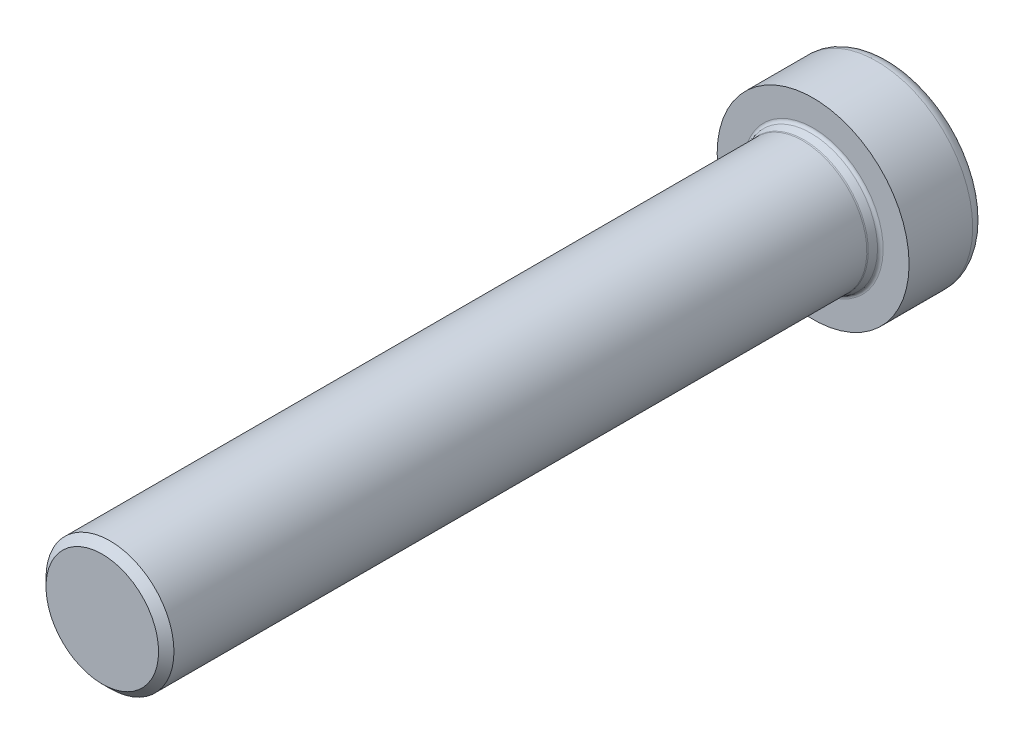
ISO-10303-21;
HEADER;
FILE_DESCRIPTION(('STEP AP214'),'2;1');
FILE_NAME('part.step','',(''),(''),'','','');
FILE_SCHEMA(('AUTOMOTIVE_DESIGN { 1 0 10303 214 1 1 1 1 }'));
ENDSEC;
DATA;
#1=APPLICATION_CONTEXT('core data for automotive mechanical design processes');
#2=APPLICATION_PROTOCOL_DEFINITION('international standard','automotive_design',2000,#1);
#3=PRODUCT_CONTEXT('',#1,'mechanical');
#4=PRODUCT('Part','Part','',(#3));
#5=PRODUCT_RELATED_PRODUCT_CATEGORY('part','',(#4));
#6=PRODUCT_DEFINITION_FORMATION('','',#4);
#7=PRODUCT_DEFINITION_CONTEXT('part definition',#1,'design');
#8=PRODUCT_DEFINITION('design','',#6,#7);
#9=PRODUCT_DEFINITION_SHAPE('','',#8);
#10=(LENGTH_UNIT() NAMED_UNIT(*) SI_UNIT(.MILLI.,.METRE.));
#11=(NAMED_UNIT(*) PLANE_ANGLE_UNIT() SI_UNIT($,.RADIAN.));
#12=(NAMED_UNIT(*) SI_UNIT($,.STERADIAN.) SOLID_ANGLE_UNIT());
#13=UNCERTAINTY_MEASURE_WITH_UNIT(LENGTH_MEASURE(1.E-05),#10,'distance_accuracy_value','');
#14=(GEOMETRIC_REPRESENTATION_CONTEXT(3) GLOBAL_UNCERTAINTY_ASSIGNED_CONTEXT((#13)) GLOBAL_UNIT_ASSIGNED_CONTEXT((#10,
#11,#12)) REPRESENTATION_CONTEXT('',''));
#15=CARTESIAN_POINT('',(0.,0.,0.));
#16=DIRECTION('',(0.,0.,1.));
#17=DIRECTION('',(1.,0.,0.));
#18=AXIS2_PLACEMENT_3D('',#15,#16,#17);
#19=CARTESIAN_POINT('',(0.,0.,200.));
#20=DIRECTION('',(0.,0.,-1.));
#21=DIRECTION('',(-1.,0.,0.));
#22=AXIS2_PLACEMENT_3D('',#19,#20,#21);
#23=CYLINDRICAL_SURFACE('',#22,18.);
#24=CARTESIAN_POINT('',(0.,0.,2.89));
#25=DIRECTION('',(0.,0.,-1.));
#26=DIRECTION('',(-1.,0.,0.));
#27=AXIS2_PLACEMENT_3D('',#24,#25,#26);
#28=CIRCLE('',#27,18.);
#29=CARTESIAN_POINT('',(-18.,0.,2.89));
#30=VERTEX_POINT('',#29);
#31=EDGE_CURVE('E13',#30,#30,#28,.T.);
#32=ORIENTED_EDGE('',*,*,#31,.F.);
#33=EDGE_LOOP('',(#32));
#34=FACE_BOUND('',#33,.T.);
#35=CARTESIAN_POINT('',(0.,0.,197.835));
#36=DIRECTION('',(0.,0.,-1.));
#37=DIRECTION('',(-1.,0.,0.));
#38=AXIS2_PLACEMENT_3D('',#35,#36,#37);
#39=CIRCLE('',#38,18.);
#40=CARTESIAN_POINT('',(-18.,0.,197.835));
#41=VERTEX_POINT('',#40);
#42=EDGE_CURVE('E61',#41,#41,#39,.F.);
#43=ORIENTED_EDGE('',*,*,#42,.F.);
#44=EDGE_LOOP('',(#43));
#45=FACE_BOUND('',#44,.T.);
#46=ADVANCED_FACE('F57',(#34,#45),#23,.T.);
#47=CARTESIAN_POINT('',(0.,0.,-21.5));
#48=DIRECTION('',(0.,0.,1.));
#49=DIRECTION('',(1.,0.,0.));
#50=AXIS2_PLACEMENT_3D('',#47,#48,#49);
#51=CYLINDRICAL_SURFACE('',#50,27.);
#52=CARTESIAN_POINT('',(0.,0.,-17.9));
#53=DIRECTION('',(0.,0.,1.));
#54=DIRECTION('',(1.,0.,0.));
#55=AXIS2_PLACEMENT_3D('',#52,#53,#54);
#56=CIRCLE('',#55,27.);
#57=CARTESIAN_POINT('',(27.,0.,-17.9));
#58=VERTEX_POINT('',#57);
#59=EDGE_CURVE('E274',#58,#58,#56,.T.);
#60=ORIENTED_EDGE('',*,*,#59,.T.);
#61=EDGE_LOOP('',(#60));
#62=FACE_BOUND('',#61,.T.);
#63=CARTESIAN_POINT('',(0.,0.,0.));
#64=DIRECTION('',(0.,0.,1.));
#65=DIRECTION('',(1.,0.,0.));
#66=AXIS2_PLACEMENT_3D('',#63,#64,#65);
#67=CIRCLE('',#66,27.);
#68=CARTESIAN_POINT('',(27.,0.,0.));
#69=VERTEX_POINT('',#68);
#70=EDGE_CURVE('E271',#69,#69,#67,.T.);
#71=ORIENTED_EDGE('',*,*,#70,.F.);
#72=EDGE_LOOP('',(#71));
#73=FACE_BOUND('',#72,.T.);
#74=ADVANCED_FACE('F288',(#62,#73),#51,.T.);
#75=CARTESIAN_POINT('',(0.,0.,-21.5));
#76=DIRECTION('',(0.,0.,1.));
#77=DIRECTION('',(1.,0.,0.));
#78=AXIS2_PLACEMENT_3D('',#75,#76,#77);
#79=PLANE('',#78);
#80=DIRECTION('',(1.,0.,0.));
#81=VECTOR('',#80,1.);
#82=CARTESIAN_POINT('',(-7.62102355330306,13.5,-21.5));
#83=LINE('',#82,#81);
#84=CARTESIAN_POINT('',(-7.62102355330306,13.5,-21.5));
#85=VERTEX_POINT('',#84);
#86=CARTESIAN_POINT('',(7.62102355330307,13.5,-21.5));
#87=VERTEX_POINT('',#86);
#88=EDGE_CURVE('E73',#85,#87,#83,.T.);
#89=ORIENTED_EDGE('',*,*,#88,.F.);
#90=CARTESIAN_POINT('',(-7.62102355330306,13.2,-21.5));
#91=DIRECTION('',(0.,0.,-1.));
#92=DIRECTION('',(-1.,0.,0.));
#93=AXIS2_PLACEMENT_3D('',#90,#91,#92);
#94=CIRCLE('',#93,0.3);
#95=CARTESIAN_POINT('',(-7.88083117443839,13.35,-21.5));
#96=VERTEX_POINT('',#95);
#97=EDGE_CURVE('E155',#96,#85,#94,.T.);
#98=ORIENTED_EDGE('',*,*,#97,.F.);
#99=DIRECTION('',(0.5,0.866025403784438,0.));
#100=VECTOR('',#99,1.);
#101=CARTESIAN_POINT('',(-15.5018547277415,0.150000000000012,-21.5));
#102=LINE('',#101,#100);
#103=CARTESIAN_POINT('',(-15.5018547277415,0.150000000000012,-21.5));
#104=VERTEX_POINT('',#103);
#105=EDGE_CURVE('E173',#104,#96,#102,.T.);
#106=ORIENTED_EDGE('',*,*,#105,.F.);
#107=CARTESIAN_POINT('',(-15.2420471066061,0.,-21.5));
#108=DIRECTION('',(0.,0.,1.));
#109=DIRECTION('',(1.,0.,0.));
#110=AXIS2_PLACEMENT_3D('',#107,#108,#109);
#111=CIRCLE('',#110,0.300000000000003);
#112=CARTESIAN_POINT('',(-15.5018547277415,-0.14999999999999,-21.5));
#113=VERTEX_POINT('',#112);
#114=EDGE_CURVE('E175',#104,#113,#111,.T.);
#115=ORIENTED_EDGE('',*,*,#114,.T.);
#116=DIRECTION('',(-0.499999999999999,0.866025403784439,0.));
#117=VECTOR('',#116,1.);
#118=CARTESIAN_POINT('',(-7.8808311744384,-13.35,-21.5));
#119=LINE('',#118,#117);
#120=CARTESIAN_POINT('',(-7.8808311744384,-13.35,-21.5));
#121=VERTEX_POINT('',#120);
#122=EDGE_CURVE('E223',#121,#113,#119,.T.);
#123=ORIENTED_EDGE('',*,*,#122,.F.);
#124=CARTESIAN_POINT('',(-7.62102355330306,-13.2,-21.5));
#125=DIRECTION('',(0.,0.,-1.));
#126=DIRECTION('',(-1.,0.,0.));
#127=AXIS2_PLACEMENT_3D('',#124,#125,#126);
#128=CIRCLE('',#127,0.300000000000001);
#129=CARTESIAN_POINT('',(-7.62102355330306,-13.5,-21.5));
#130=VERTEX_POINT('',#129);
#131=EDGE_CURVE('E220',#130,#121,#128,.T.);
#132=ORIENTED_EDGE('',*,*,#131,.F.);
#133=DIRECTION('',(-1.,0.,0.));
#134=VECTOR('',#133,1.);
#135=CARTESIAN_POINT('',(7.62102355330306,-13.5,-21.5));
#136=LINE('',#135,#134);
#137=CARTESIAN_POINT('',(7.62102355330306,-13.5,-21.5));
#138=VERTEX_POINT('',#137);
#139=EDGE_CURVE('E218',#138,#130,#136,.T.);
#140=ORIENTED_EDGE('',*,*,#139,.F.);
#141=CARTESIAN_POINT('',(7.62102355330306,-13.2,-21.5));
#142=DIRECTION('',(0.,0.,-1.));
#143=DIRECTION('',(-1.,0.,0.));
#144=AXIS2_PLACEMENT_3D('',#141,#142,#143);
#145=CIRCLE('',#144,0.299999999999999);
#146=CARTESIAN_POINT('',(7.88083117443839,-13.35,-21.5));
#147=VERTEX_POINT('',#146);
#148=EDGE_CURVE('E215',#147,#138,#145,.T.);
#149=ORIENTED_EDGE('',*,*,#148,.F.);
#150=DIRECTION('',(-0.5,-0.866025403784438,0.));
#151=VECTOR('',#150,1.);
#152=CARTESIAN_POINT('',(15.5018547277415,-0.150000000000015,-21.5));
#153=LINE('',#152,#151);
#154=CARTESIAN_POINT('',(15.5018547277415,-0.150000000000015,-21.5));
#155=VERTEX_POINT('',#154);
#156=EDGE_CURVE('E213',#155,#147,#153,.T.);
#157=ORIENTED_EDGE('',*,*,#156,.F.);
#158=CARTESIAN_POINT('',(15.2420471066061,0.,-21.5));
#159=DIRECTION('',(0.,0.,-1.));
#160=DIRECTION('',(-1.,0.,0.));
#161=AXIS2_PLACEMENT_3D('',#158,#159,#160);
#162=CIRCLE('',#161,0.299999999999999);
#163=CARTESIAN_POINT('',(15.5018547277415,0.149999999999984,-21.5));
#164=VERTEX_POINT('',#163);
#165=EDGE_CURVE('E210',#164,#155,#162,.T.);
#166=ORIENTED_EDGE('',*,*,#165,.F.);
#167=DIRECTION('',(0.499999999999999,-0.866025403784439,0.));
#168=VECTOR('',#167,1.);
#169=CARTESIAN_POINT('',(7.8808311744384,13.35,-21.5));
#170=LINE('',#169,#168);
#171=CARTESIAN_POINT('',(7.8808311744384,13.35,-21.5));
#172=VERTEX_POINT('',#171);
#173=EDGE_CURVE('E208',#172,#164,#170,.T.);
#174=ORIENTED_EDGE('',*,*,#173,.F.);
#175=CARTESIAN_POINT('',(7.62102355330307,13.2,-21.5));
#176=DIRECTION('',(0.,0.,-1.));
#177=DIRECTION('',(-1.,0.,0.));
#178=AXIS2_PLACEMENT_3D('',#175,#176,#177);
#179=CIRCLE('',#178,0.300000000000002);
#180=EDGE_CURVE('E205',#87,#172,#179,.T.);
#181=ORIENTED_EDGE('',*,*,#180,.F.);
#182=EDGE_LOOP('',(#89,#98,#106,#115,#123,#132,#140,#149,#157,#166,#174,#181));
#183=FACE_BOUND('',#182,.T.);
#184=CARTESIAN_POINT('',(0.,0.,-21.5));
#185=DIRECTION('',(0.,0.,1.));
#186=DIRECTION('',(1.,0.,0.));
#187=AXIS2_PLACEMENT_3D('',#184,#185,#186);
#188=CIRCLE('',#187,23.4);
#189=CARTESIAN_POINT('',(23.4,0.,-21.5));
#190=VERTEX_POINT('',#189);
#191=EDGE_CURVE('E66',#190,#190,#188,.F.);
#192=ORIENTED_EDGE('',*,*,#191,.T.);
#193=EDGE_LOOP('',(#192));
#194=FACE_BOUND('',#193,.T.);
#195=ADVANCED_FACE('F280',(#183,#194),#79,.F.);
#196=CARTESIAN_POINT('',(0.,0.,0.));
#197=DIRECTION('',(0.,0.,1.));
#198=DIRECTION('',(1.,0.,0.));
#199=AXIS2_PLACEMENT_3D('',#196,#197,#198);
#200=PLANE('',#199);
#201=CARTESIAN_POINT('',(0.,0.,0.));
#202=DIRECTION('',(0.,0.,-1.));
#203=DIRECTION('',(0.,1.,0.));
#204=AXIS2_PLACEMENT_3D('',#201,#202,#203);
#205=CIRCLE('',#204,19.7);
#206=CARTESIAN_POINT('',(0.,19.7,0.));
#207=VERTEX_POINT('',#206);
#208=EDGE_CURVE('E265',#207,#207,#205,.T.);
#209=ORIENTED_EDGE('',*,*,#208,.T.);
#210=EDGE_LOOP('',(#209));
#211=FACE_BOUND('',#210,.T.);
#212=ORIENTED_EDGE('',*,*,#70,.T.);
#213=EDGE_LOOP('',(#212));
#214=FACE_BOUND('',#213,.T.);
#215=ADVANCED_FACE('F285',(#211,#214),#200,.T.);
#216=CARTESIAN_POINT('',(0.,0.,-17.9));
#217=DIRECTION('',(0.,0.,1.));
#218=DIRECTION('',(1.,0.,0.));
#219=AXIS2_PLACEMENT_3D('',#216,#217,#218);
#220=TOROIDAL_SURFACE('',#219,23.4,3.6);
#221=ORIENTED_EDGE('',*,*,#191,.F.);
#222=EDGE_LOOP('',(#221));
#223=FACE_BOUND('',#222,.T.);
#224=ORIENTED_EDGE('',*,*,#59,.F.);
#225=EDGE_LOOP('',(#224));
#226=FACE_BOUND('',#225,.T.);
#227=ADVANCED_FACE('F59',(#223,#226),#220,.T.);
#228=CARTESIAN_POINT('',(0.,0.,2.5426856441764));
#229=DIRECTION('',(0.,0.,-1.));
#230=DIRECTION('',(0.,1.,0.));
#231=AXIS2_PLACEMENT_3D('',#228,#229,#230);
#232=CONICAL_SURFACE('',#231,18.0622512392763,0.354705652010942);
#233=CARTESIAN_POINT('',(0.,0.,0.652685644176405));
#234=DIRECTION('',(0.,0.,-1.));
#235=DIRECTION('',(0.,1.,0.));
#236=AXIS2_PLACEMENT_3D('',#233,#234,#235);
#237=CIRCLE('',#236,18.7622512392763);
#238=CARTESIAN_POINT('',(0.,18.7622512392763,0.652685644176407));
#239=VERTEX_POINT('',#238);
#240=EDGE_CURVE('E262',#239,#239,#237,.T.);
#241=ORIENTED_EDGE('',*,*,#240,.F.);
#242=EDGE_LOOP('',(#241));
#243=FACE_BOUND('',#242,.T.);
#244=CARTESIAN_POINT('',(0.,0.,2.5426856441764));
#245=DIRECTION('',(0.,0.,-1.));
#246=DIRECTION('',(0.,1.,0.));
#247=AXIS2_PLACEMENT_3D('',#244,#245,#246);
#248=CIRCLE('',#247,18.0622512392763);
#249=CARTESIAN_POINT('',(0.,18.0622512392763,2.5426856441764));
#250=VERTEX_POINT('',#249);
#251=EDGE_CURVE('E268',#250,#250,#248,.T.);
#252=ORIENTED_EDGE('',*,*,#251,.T.);
#253=EDGE_LOOP('',(#252));
#254=FACE_BOUND('',#253,.T.);
#255=ADVANCED_FACE('F284',(#243,#254),#232,.T.);
#256=CARTESIAN_POINT('',(0.,0.,2.89));
#257=DIRECTION('',(0.,0.,-1.));
#258=DIRECTION('',(0.,1.,0.));
#259=AXIS2_PLACEMENT_3D('',#256,#257,#258);
#260=TOROIDAL_SURFACE('',#259,19.,1.);
#261=ORIENTED_EDGE('',*,*,#31,.T.);
#262=EDGE_LOOP('',(#261));
#263=FACE_BOUND('',#262,.T.);
#264=ORIENTED_EDGE('',*,*,#251,.F.);
#265=EDGE_LOOP('',(#264));
#266=FACE_BOUND('',#265,.T.);
#267=ADVANCED_FACE('F315',(#263,#266),#260,.F.);
#268=CARTESIAN_POINT('',(0.,0.,1.));
#269=DIRECTION('',(0.,0.,-1.));
#270=DIRECTION('',(0.,1.,0.));
#271=AXIS2_PLACEMENT_3D('',#268,#269,#270);
#272=TOROIDAL_SURFACE('',#271,19.7,1.);
#273=ORIENTED_EDGE('',*,*,#208,.F.);
#274=EDGE_LOOP('',(#273));
#275=FACE_BOUND('',#274,.T.);
#276=ORIENTED_EDGE('',*,*,#240,.T.);
#277=EDGE_LOOP('',(#276));
#278=FACE_BOUND('',#277,.T.);
#279=ADVANCED_FACE('F319',(#275,#278),#272,.F.);
#280=CARTESIAN_POINT('',(0.,0.,200.));
#281=DIRECTION('',(0.,0.,-1.));
#282=DIRECTION('',(1.,0.,0.));
#283=AXIS2_PLACEMENT_3D('',#280,#281,#282);
#284=CONICAL_SURFACE('',#283,15.835,0.785398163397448);
#285=CARTESIAN_POINT('',(0.,0.,200.));
#286=DIRECTION('',(0.,0.,1.));
#287=DIRECTION('',(1.,0.,0.));
#288=AXIS2_PLACEMENT_3D('',#285,#286,#287);
#289=CIRCLE('',#288,15.835);
#290=CARTESIAN_POINT('',(15.835,0.,200.));
#291=VERTEX_POINT('',#290);
#292=EDGE_CURVE('E259',#291,#291,#289,.T.);
#293=ORIENTED_EDGE('',*,*,#292,.F.);
#294=EDGE_LOOP('',(#293));
#295=FACE_BOUND('',#294,.T.);
#296=ORIENTED_EDGE('',*,*,#42,.T.);
#297=EDGE_LOOP('',(#296));
#298=FACE_BOUND('',#297,.T.);
#299=ADVANCED_FACE('F311',(#295,#298),#284,.T.);
#300=CARTESIAN_POINT('',(0.,0.,200.));
#301=DIRECTION('',(0.,0.,1.));
#302=DIRECTION('',(1.,0.,0.));
#303=AXIS2_PLACEMENT_3D('',#300,#301,#302);
#304=PLANE('',#303);
#305=ORIENTED_EDGE('',*,*,#292,.T.);
#306=EDGE_LOOP('',(#305));
#307=FACE_BOUND('',#306,.T.);
#308=ADVANCED_FACE('F308',(#307),#304,.T.);
#309=CARTESIAN_POINT('',(-7.62102355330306,13.2,2.5));
#310=DIRECTION('',(0.,0.,-1.));
#311=DIRECTION('',(-1.,0.,0.));
#312=AXIS2_PLACEMENT_3D('',#309,#310,#311);
#313=PLANE('',#312);
#314=CARTESIAN_POINT('',(-7.62102355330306,13.2,2.5));
#315=DIRECTION('',(0.,0.,-1.));
#316=DIRECTION('',(-1.,0.,0.));
#317=AXIS2_PLACEMENT_3D('',#314,#315,#316);
#318=CIRCLE('',#317,0.3);
#319=CARTESIAN_POINT('',(-7.88083117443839,13.35,2.5));
#320=VERTEX_POINT('',#319);
#321=CARTESIAN_POINT('',(-7.62102355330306,13.5,2.5));
#322=VERTEX_POINT('',#321);
#323=EDGE_CURVE('E153',#320,#322,#318,.T.);
#324=ORIENTED_EDGE('',*,*,#323,.T.);
#325=DIRECTION('',(1.,0.,0.));
#326=VECTOR('',#325,1.);
#327=CARTESIAN_POINT('',(-7.62102355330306,13.5,2.5));
#328=LINE('',#327,#326);
#329=CARTESIAN_POINT('',(7.62102355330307,13.5,2.5));
#330=VERTEX_POINT('',#329);
#331=EDGE_CURVE('E161',#322,#330,#328,.T.);
#332=ORIENTED_EDGE('',*,*,#331,.T.);
#333=CARTESIAN_POINT('',(7.62102355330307,13.2,2.5));
#334=DIRECTION('',(0.,0.,-1.));
#335=DIRECTION('',(-1.,0.,0.));
#336=AXIS2_PLACEMENT_3D('',#333,#334,#335);
#337=CIRCLE('',#336,0.300000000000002);
#338=CARTESIAN_POINT('',(7.8808311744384,13.35,2.5));
#339=VERTEX_POINT('',#338);
#340=EDGE_CURVE('E167',#330,#339,#337,.T.);
#341=ORIENTED_EDGE('',*,*,#340,.T.);
#342=DIRECTION('',(0.499999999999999,-0.866025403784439,0.));
#343=VECTOR('',#342,1.);
#344=CARTESIAN_POINT('',(7.8808311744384,13.35,2.5));
#345=LINE('',#344,#343);
#346=CARTESIAN_POINT('',(15.5018547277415,0.149999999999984,2.5));
#347=VERTEX_POINT('',#346);
#348=EDGE_CURVE('E179',#339,#347,#345,.T.);
#349=ORIENTED_EDGE('',*,*,#348,.T.);
#350=CARTESIAN_POINT('',(15.2420471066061,0.,2.5));
#351=DIRECTION('',(0.,0.,-1.));
#352=DIRECTION('',(-1.,0.,0.));
#353=AXIS2_PLACEMENT_3D('',#350,#351,#352);
#354=CIRCLE('',#353,0.299999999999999);
#355=CARTESIAN_POINT('',(15.5018547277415,-0.150000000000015,2.5));
#356=VERTEX_POINT('',#355);
#357=EDGE_CURVE('E182',#347,#356,#354,.T.);
#358=ORIENTED_EDGE('',*,*,#357,.T.);
#359=DIRECTION('',(-0.5,-0.866025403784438,0.));
#360=VECTOR('',#359,1.);
#361=CARTESIAN_POINT('',(15.5018547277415,-0.150000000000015,2.5));
#362=LINE('',#361,#360);
#363=CARTESIAN_POINT('',(7.88083117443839,-13.35,2.5));
#364=VERTEX_POINT('',#363);
#365=EDGE_CURVE('E185',#356,#364,#362,.T.);
#366=ORIENTED_EDGE('',*,*,#365,.T.);
#367=CARTESIAN_POINT('',(7.62102355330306,-13.2,2.5));
#368=DIRECTION('',(0.,0.,-1.));
#369=DIRECTION('',(-1.,0.,0.));
#370=AXIS2_PLACEMENT_3D('',#367,#368,#369);
#371=CIRCLE('',#370,0.299999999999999);
#372=CARTESIAN_POINT('',(7.62102355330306,-13.5,2.5));
#373=VERTEX_POINT('',#372);
#374=EDGE_CURVE('E188',#364,#373,#371,.T.);
#375=ORIENTED_EDGE('',*,*,#374,.T.);
#376=DIRECTION('',(-1.,0.,0.));
#377=VECTOR('',#376,1.);
#378=CARTESIAN_POINT('',(7.62102355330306,-13.5,2.5));
#379=LINE('',#378,#377);
#380=CARTESIAN_POINT('',(-7.62102355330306,-13.5,2.5));
#381=VERTEX_POINT('',#380);
#382=EDGE_CURVE('E191',#373,#381,#379,.T.);
#383=ORIENTED_EDGE('',*,*,#382,.T.);
#384=CARTESIAN_POINT('',(-7.62102355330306,-13.2,2.5));
#385=DIRECTION('',(0.,0.,-1.));
#386=DIRECTION('',(-1.,0.,0.));
#387=AXIS2_PLACEMENT_3D('',#384,#385,#386);
#388=CIRCLE('',#387,0.300000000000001);
#389=CARTESIAN_POINT('',(-7.8808311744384,-13.35,2.5));
#390=VERTEX_POINT('',#389);
#391=EDGE_CURVE('E194',#381,#390,#388,.T.);
#392=ORIENTED_EDGE('',*,*,#391,.T.);
#393=DIRECTION('',(-0.499999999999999,0.866025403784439,0.));
#394=VECTOR('',#393,1.);
#395=CARTESIAN_POINT('',(-7.8808311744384,-13.35,2.5));
#396=LINE('',#395,#394);
#397=CARTESIAN_POINT('',(-15.5018547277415,-0.14999999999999,2.5));
#398=VERTEX_POINT('',#397);
#399=EDGE_CURVE('E197',#390,#398,#396,.T.);
#400=ORIENTED_EDGE('',*,*,#399,.T.);
#401=CARTESIAN_POINT('',(-15.2420471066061,0.,2.5));
#402=DIRECTION('',(0.,0.,1.));
#403=DIRECTION('',(1.,0.,0.));
#404=AXIS2_PLACEMENT_3D('',#401,#402,#403);
#405=CIRCLE('',#404,0.300000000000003);
#406=CARTESIAN_POINT('',(-15.5018547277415,0.150000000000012,2.5));
#407=VERTEX_POINT('',#406);
#408=EDGE_CURVE('E200',#407,#398,#405,.T.);
#409=ORIENTED_EDGE('',*,*,#408,.F.);
#410=DIRECTION('',(0.5,0.866025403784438,0.));
#411=VECTOR('',#410,1.);
#412=CARTESIAN_POINT('',(-15.5018547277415,0.150000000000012,2.5));
#413=LINE('',#412,#411);
#414=EDGE_CURVE('E158',#407,#320,#413,.T.);
#415=ORIENTED_EDGE('',*,*,#414,.T.);
#416=EDGE_LOOP('',(#324,#332,#341,#349,#358,#366,#375,#383,#392,#400,#409,#415));
#417=FACE_BOUND('',#416,.T.);
#418=CARTESIAN_POINT('',(0.,0.,2.5));
#419=DIRECTION('',(0.,0.,-1.));
#420=DIRECTION('',(-1.,0.,0.));
#421=AXIS2_PLACEMENT_3D('',#418,#419,#420);
#422=CIRCLE('',#421,9.00000000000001);
#423=CARTESIAN_POINT('',(-9.00000000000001,0.,2.5));
#424=VERTEX_POINT('',#423);
#425=EDGE_CURVE('E229',#424,#424,#422,.F.);
#426=ORIENTED_EDGE('',*,*,#425,.T.);
#427=EDGE_LOOP('',(#426));
#428=FACE_BOUND('',#427,.T.);
#429=ADVANCED_FACE('F169',(#417,#428),#313,.T.);
#430=CARTESIAN_POINT('',(-7.62102355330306,13.2,2.5));
#431=DIRECTION('',(0.,0.,-1.));
#432=DIRECTION('',(-1.,0.,0.));
#433=AXIS2_PLACEMENT_3D('',#430,#431,#432);
#434=CYLINDRICAL_SURFACE('',#433,0.3);
#435=ORIENTED_EDGE('',*,*,#97,.T.);
#436=DIRECTION('',(0.,0.,-1.));
#437=VECTOR('',#436,1.);
#438=CARTESIAN_POINT('',(-7.62102355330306,13.5,2.5));
#439=LINE('',#438,#437);
#440=EDGE_CURVE('E148',#322,#85,#439,.T.);
#441=ORIENTED_EDGE('',*,*,#440,.F.);
#442=ORIENTED_EDGE('',*,*,#323,.F.);
#443=DIRECTION('',(0.,0.,-1.));
#444=VECTOR('',#443,1.);
#445=CARTESIAN_POINT('',(-7.88083117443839,13.35,2.5));
#446=LINE('',#445,#444);
#447=EDGE_CURVE('E227',#320,#96,#446,.T.);
#448=ORIENTED_EDGE('',*,*,#447,.T.);
#449=EDGE_LOOP('',(#435,#441,#442,#448));
#450=FACE_BOUND('',#449,.T.);
#451=ADVANCED_FACE('F150',(#450),#434,.F.);
#452=CARTESIAN_POINT('',(-15.5018547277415,0.150000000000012,2.5));
#453=DIRECTION('',(-0.866025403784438,0.500000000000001,0.));
#454=DIRECTION('',(-0.500000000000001,-0.866025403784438,0.));
#455=AXIS2_PLACEMENT_3D('',#452,#453,#454);
#456=PLANE('',#455);
#457=DIRECTION('',(0.,0.,-1.));
#458=VECTOR('',#457,1.);
#459=CARTESIAN_POINT('',(-15.5018547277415,0.150000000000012,2.5));
#460=LINE('',#459,#458);
#461=EDGE_CURVE('E230',#407,#104,#460,.T.);
#462=ORIENTED_EDGE('',*,*,#461,.T.);
#463=ORIENTED_EDGE('',*,*,#105,.T.);
#464=ORIENTED_EDGE('',*,*,#447,.F.);
#465=ORIENTED_EDGE('',*,*,#414,.F.);
#466=EDGE_LOOP('',(#462,#463,#464,#465));
#467=FACE_BOUND('',#466,.T.);
#468=ADVANCED_FACE('F332',(#467),#456,.F.);
#469=CARTESIAN_POINT('',(-15.2420471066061,0.,2.5));
#470=DIRECTION('',(0.,0.,-1.));
#471=DIRECTION('',(-1.,0.,0.));
#472=AXIS2_PLACEMENT_3D('',#469,#470,#471);
#473=CYLINDRICAL_SURFACE('',#472,0.300000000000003);
#474=ORIENTED_EDGE('',*,*,#114,.F.);
#475=ORIENTED_EDGE('',*,*,#461,.F.);
#476=ORIENTED_EDGE('',*,*,#408,.T.);
#477=DIRECTION('',(0.,0.,-1.));
#478=VECTOR('',#477,1.);
#479=CARTESIAN_POINT('',(-15.5018547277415,-0.14999999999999,2.5));
#480=LINE('',#479,#478);
#481=EDGE_CURVE('E233',#398,#113,#480,.T.);
#482=ORIENTED_EDGE('',*,*,#481,.T.);
#483=EDGE_LOOP('',(#474,#475,#476,#482));
#484=FACE_BOUND('',#483,.T.);
#485=ADVANCED_FACE('F366',(#484),#473,.F.);
#486=CARTESIAN_POINT('',(-7.8808311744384,-13.35,2.5));
#487=DIRECTION('',(-0.866025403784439,-0.499999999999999,0.));
#488=DIRECTION('',(0.499999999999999,-0.866025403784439,0.));
#489=AXIS2_PLACEMENT_3D('',#486,#487,#488);
#490=PLANE('',#489);
#491=ORIENTED_EDGE('',*,*,#122,.T.);
#492=ORIENTED_EDGE('',*,*,#481,.F.);
#493=ORIENTED_EDGE('',*,*,#399,.F.);
#494=DIRECTION('',(0.,0.,-1.));
#495=VECTOR('',#494,1.);
#496=CARTESIAN_POINT('',(-7.8808311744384,-13.35,2.5));
#497=LINE('',#496,#495);
#498=EDGE_CURVE('E236',#390,#121,#497,.T.);
#499=ORIENTED_EDGE('',*,*,#498,.T.);
#500=EDGE_LOOP('',(#491,#492,#493,#499));
#501=FACE_BOUND('',#500,.T.);
#502=ADVANCED_FACE('F362',(#501),#490,.F.);
#503=CARTESIAN_POINT('',(-7.62102355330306,-13.2,2.5));
#504=DIRECTION('',(0.,0.,-1.));
#505=DIRECTION('',(-1.,0.,0.));
#506=AXIS2_PLACEMENT_3D('',#503,#504,#505);
#507=CYLINDRICAL_SURFACE('',#506,0.300000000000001);
#508=ORIENTED_EDGE('',*,*,#131,.T.);
#509=ORIENTED_EDGE('',*,*,#498,.F.);
#510=ORIENTED_EDGE('',*,*,#391,.F.);
#511=DIRECTION('',(0.,0.,-1.));
#512=VECTOR('',#511,1.);
#513=CARTESIAN_POINT('',(-7.62102355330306,-13.5,2.5));
#514=LINE('',#513,#512);
#515=EDGE_CURVE('E238',#381,#130,#514,.T.);
#516=ORIENTED_EDGE('',*,*,#515,.T.);
#517=EDGE_LOOP('',(#508,#509,#510,#516));
#518=FACE_BOUND('',#517,.T.);
#519=ADVANCED_FACE('F358',(#518),#507,.F.);
#520=CARTESIAN_POINT('',(7.62102355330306,-13.5,2.5));
#521=DIRECTION('',(0.,-1.,0.));
#522=DIRECTION('',(1.,0.,0.));
#523=AXIS2_PLACEMENT_3D('',#520,#521,#522);
#524=PLANE('',#523);
#525=DIRECTION('',(0.,0.,-1.));
#526=VECTOR('',#525,1.);
#527=CARTESIAN_POINT('',(7.62102355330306,-13.5,2.5));
#528=LINE('',#527,#526);
#529=EDGE_CURVE('E241',#373,#138,#528,.T.);
#530=ORIENTED_EDGE('',*,*,#529,.T.);
#531=ORIENTED_EDGE('',*,*,#139,.T.);
#532=ORIENTED_EDGE('',*,*,#515,.F.);
#533=ORIENTED_EDGE('',*,*,#382,.F.);
#534=EDGE_LOOP('',(#530,#531,#532,#533));
#535=FACE_BOUND('',#534,.T.);
#536=ADVANCED_FACE('F354',(#535),#524,.F.);
#537=CARTESIAN_POINT('',(7.62102355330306,-13.2,2.5));
#538=DIRECTION('',(0.,0.,-1.));
#539=DIRECTION('',(-1.,0.,0.));
#540=AXIS2_PLACEMENT_3D('',#537,#538,#539);
#541=CYLINDRICAL_SURFACE('',#540,0.299999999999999);
#542=ORIENTED_EDGE('',*,*,#148,.T.);
#543=ORIENTED_EDGE('',*,*,#529,.F.);
#544=ORIENTED_EDGE('',*,*,#374,.F.);
#545=DIRECTION('',(0.,0.,-1.));
#546=VECTOR('',#545,1.);
#547=CARTESIAN_POINT('',(7.88083117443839,-13.35,2.5));
#548=LINE('',#547,#546);
#549=EDGE_CURVE('E244',#364,#147,#548,.T.);
#550=ORIENTED_EDGE('',*,*,#549,.T.);
#551=EDGE_LOOP('',(#542,#543,#544,#550));
#552=FACE_BOUND('',#551,.T.);
#553=ADVANCED_FACE('F350',(#552),#541,.F.);
#554=CARTESIAN_POINT('',(15.5018547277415,-0.150000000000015,2.5));
#555=DIRECTION('',(0.866025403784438,-0.5,0.));
#556=DIRECTION('',(0.5,0.866025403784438,0.));
#557=AXIS2_PLACEMENT_3D('',#554,#555,#556);
#558=PLANE('',#557);
#559=DIRECTION('',(0.,0.,-1.));
#560=VECTOR('',#559,1.);
#561=CARTESIAN_POINT('',(15.5018547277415,-0.150000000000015,2.5));
#562=LINE('',#561,#560);
#563=EDGE_CURVE('E247',#356,#155,#562,.T.);
#564=ORIENTED_EDGE('',*,*,#563,.T.);
#565=ORIENTED_EDGE('',*,*,#156,.T.);
#566=ORIENTED_EDGE('',*,*,#549,.F.);
#567=ORIENTED_EDGE('',*,*,#365,.F.);
#568=EDGE_LOOP('',(#564,#565,#566,#567));
#569=FACE_BOUND('',#568,.T.);
#570=ADVANCED_FACE('F346',(#569),#558,.F.);
#571=CARTESIAN_POINT('',(15.2420471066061,0.,2.5));
#572=DIRECTION('',(0.,0.,-1.));
#573=DIRECTION('',(-1.,0.,0.));
#574=AXIS2_PLACEMENT_3D('',#571,#572,#573);
#575=CYLINDRICAL_SURFACE('',#574,0.299999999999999);
#576=ORIENTED_EDGE('',*,*,#165,.T.);
#577=ORIENTED_EDGE('',*,*,#563,.F.);
#578=ORIENTED_EDGE('',*,*,#357,.F.);
#579=DIRECTION('',(0.,0.,-1.));
#580=VECTOR('',#579,1.);
#581=CARTESIAN_POINT('',(15.5018547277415,0.149999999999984,2.5));
#582=LINE('',#581,#580);
#583=EDGE_CURVE('E250',#347,#164,#582,.T.);
#584=ORIENTED_EDGE('',*,*,#583,.T.);
#585=EDGE_LOOP('',(#576,#577,#578,#584));
#586=FACE_BOUND('',#585,.T.);
#587=ADVANCED_FACE('F342',(#586),#575,.F.);
#588=CARTESIAN_POINT('',(7.8808311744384,13.35,2.5));
#589=DIRECTION('',(0.866025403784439,0.499999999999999,0.));
#590=DIRECTION('',(-0.499999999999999,0.866025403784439,0.));
#591=AXIS2_PLACEMENT_3D('',#588,#589,#590);
#592=PLANE('',#591);
#593=DIRECTION('',(0.,0.,-1.));
#594=VECTOR('',#593,1.);
#595=CARTESIAN_POINT('',(7.8808311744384,13.35,2.5));
#596=LINE('',#595,#594);
#597=EDGE_CURVE('E253',#339,#172,#596,.T.);
#598=ORIENTED_EDGE('',*,*,#597,.T.);
#599=ORIENTED_EDGE('',*,*,#173,.T.);
#600=ORIENTED_EDGE('',*,*,#583,.F.);
#601=ORIENTED_EDGE('',*,*,#348,.F.);
#602=EDGE_LOOP('',(#598,#599,#600,#601));
#603=FACE_BOUND('',#602,.T.);
#604=ADVANCED_FACE('F338',(#603),#592,.F.);
#605=CARTESIAN_POINT('',(7.62102355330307,13.2,2.5));
#606=DIRECTION('',(0.,0.,-1.));
#607=DIRECTION('',(-1.,0.,0.));
#608=AXIS2_PLACEMENT_3D('',#605,#606,#607);
#609=CYLINDRICAL_SURFACE('',#608,0.300000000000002);
#610=ORIENTED_EDGE('',*,*,#180,.T.);
#611=ORIENTED_EDGE('',*,*,#597,.F.);
#612=ORIENTED_EDGE('',*,*,#340,.F.);
#613=DIRECTION('',(0.,0.,-1.));
#614=VECTOR('',#613,1.);
#615=CARTESIAN_POINT('',(7.62102355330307,13.5,2.5));
#616=LINE('',#615,#614);
#617=EDGE_CURVE('E157',#330,#87,#616,.T.);
#618=ORIENTED_EDGE('',*,*,#617,.T.);
#619=EDGE_LOOP('',(#610,#611,#612,#618));
#620=FACE_BOUND('',#619,.T.);
#621=ADVANCED_FACE('F335',(#620),#609,.F.);
#622=CARTESIAN_POINT('',(-7.62102355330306,13.5,2.5));
#623=DIRECTION('',(0.,1.,0.));
#624=DIRECTION('',(0.,0.,1.));
#625=AXIS2_PLACEMENT_3D('',#622,#623,#624);
#626=PLANE('',#625);
#627=ORIENTED_EDGE('',*,*,#440,.T.);
#628=ORIENTED_EDGE('',*,*,#88,.T.);
#629=ORIENTED_EDGE('',*,*,#617,.F.);
#630=ORIENTED_EDGE('',*,*,#331,.F.);
#631=EDGE_LOOP('',(#627,#628,#629,#630));
#632=FACE_BOUND('',#631,.T.);
#633=ADVANCED_FACE('F162',(#632),#626,.F.);
#634=CARTESIAN_POINT('',(0.,0.,2.50000000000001));
#635=DIRECTION('',(0.,0.,-1.));
#636=DIRECTION('',(0.,1.,0.));
#637=AXIS2_PLACEMENT_3D('',#634,#635,#636);
#638=CONICAL_SURFACE('',#637,9.,1.04719755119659);
#639=CARTESIAN_POINT('',(0.,0.,7.69615242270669));
#640=VERTEX_POINT('',#639);
#641=VERTEX_LOOP('',#640);
#642=FACE_BOUND('',#641,.T.);
#643=ORIENTED_EDGE('',*,*,#425,.F.);
#644=EDGE_LOOP('',(#643));
#645=FACE_BOUND('',#644,.T.);
#646=ADVANCED_FACE('F327',(#642,#645),#638,.F.);
#647=CLOSED_SHELL('',(#46,#74,#195,#215,#227,#255,#267,#279,#299,#308,#429,#451,#468,#485,#502,
#519,#536,#553,#570,#587,#604,#621,#633,#646));
#648=MANIFOLD_SOLID_BREP('B2',#647);
#649=ADVANCED_BREP_SHAPE_REPRESENTATION('',(#18,#648),#14);
#650=SHAPE_DEFINITION_REPRESENTATION(#9,#649);
ENDSEC;
END-ISO-10303-21;
